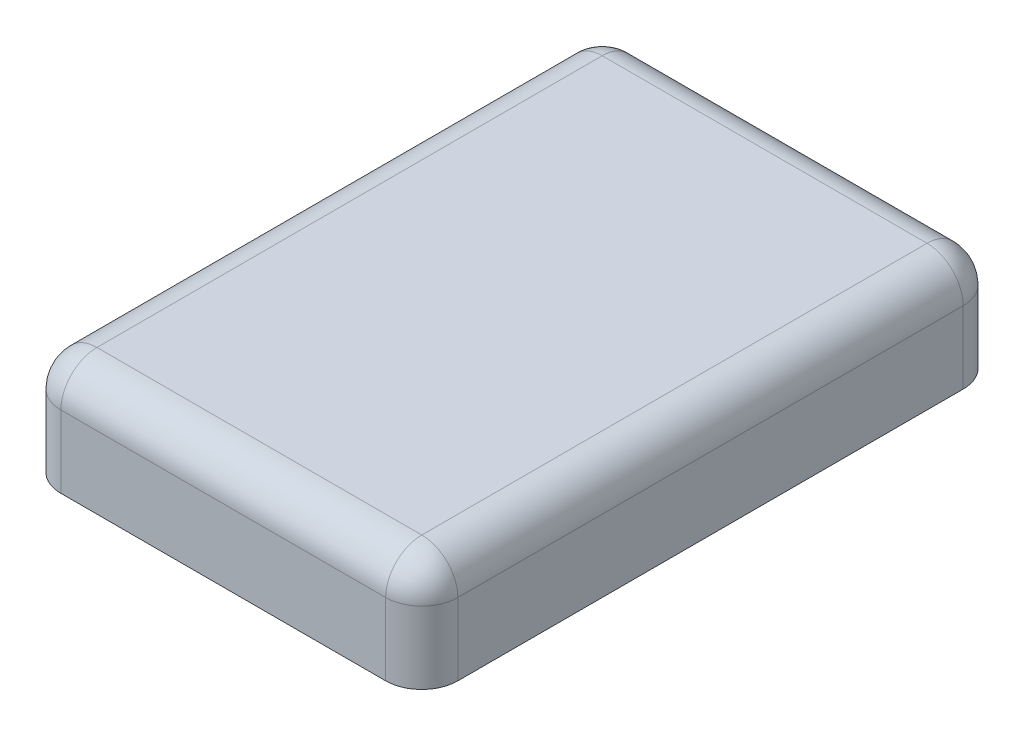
from build123d import *

# Parameters (mm, degrees)
BASES_W    = 2.2
BASES_H    = 3.2
BASE_DEPTH = 0.6
SIDEF_R    = 0.2
TOPF_R     = 0.2


with BuildPart() as part:
    # BaseS → Base (new body)
    with BuildSketch(Plane(origin=(0, 0, 0), x_dir=(1, 0, 0), z_dir=(0, 1, 0))):
        Rectangle(BASES_W, BASES_H)
    extrude(amount=BASE_DEPTH)

    # SideF
    sidef_edges = [part.edges().sort_by_distance(p)[0] for p in [
        (1.1, 0.3, 1.6),
        (-1.1, 0.3, 1.6),
        (-1.1, 0.3, -1.6),
        (1.1, 0.3, -1.6),
    ]]
    fillet(sidef_edges, radius=SIDEF_R)

    # TopF
    topf_edges = [part.edges().sort_by_distance(p)[0] for p in [
        (1.1, 0.6, 0),
        (0, 0.6, 1.6),
        (0, 0.6, -1.6),
        (-1.1, 0.6, 0),
        (-1.041421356, 0.6, -1.541421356),
        (-1.041421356, 0.6, 1.541421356),
        (1.041421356, 0.6, -1.541421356),
        (1.041421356, 0.6, 1.541421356),
    ]]
    fillet(topf_edges, radius=TOPF_R)


solid = part.part
